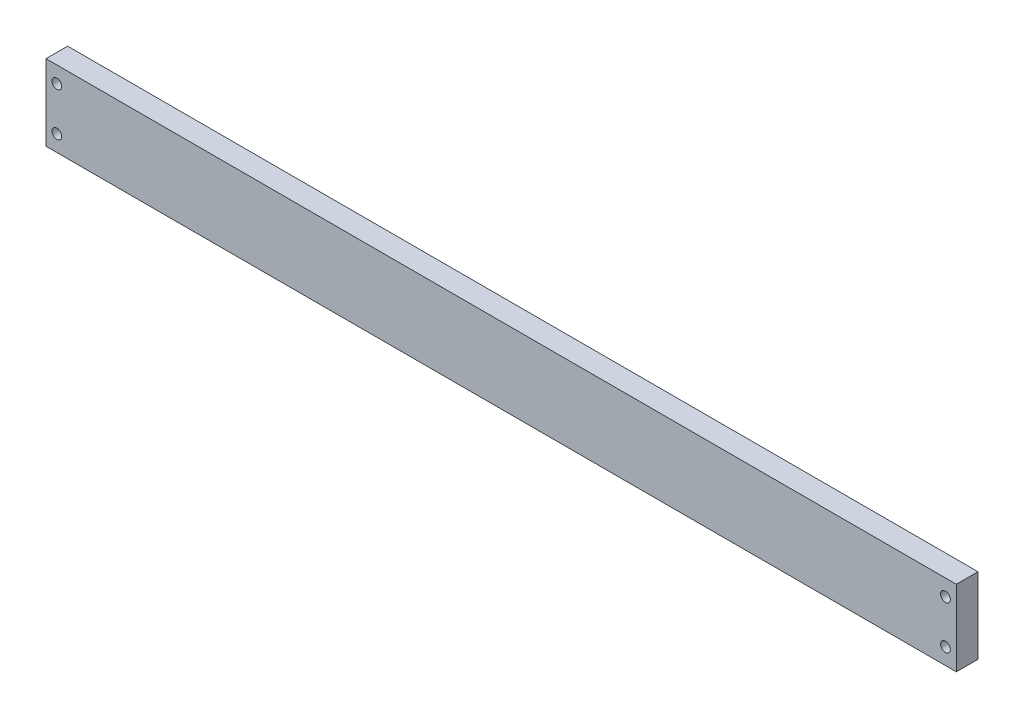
ISO-10303-21;
HEADER;
FILE_DESCRIPTION(('STEP AP214'),'2;1');
FILE_NAME('part.step','',(''),(''),'','','');
FILE_SCHEMA(('AUTOMOTIVE_DESIGN { 1 0 10303 214 1 1 1 1 }'));
ENDSEC;
DATA;
#1=APPLICATION_CONTEXT('core data for automotive mechanical design processes');
#2=APPLICATION_PROTOCOL_DEFINITION('international standard','automotive_design',2000,#1);
#3=PRODUCT_CONTEXT('',#1,'mechanical');
#4=PRODUCT('Part','Part','',(#3));
#5=PRODUCT_RELATED_PRODUCT_CATEGORY('part','',(#4));
#6=PRODUCT_DEFINITION_FORMATION('','',#4);
#7=PRODUCT_DEFINITION_CONTEXT('part definition',#1,'design');
#8=PRODUCT_DEFINITION('design','',#6,#7);
#9=PRODUCT_DEFINITION_SHAPE('','',#8);
#10=(LENGTH_UNIT() NAMED_UNIT(*) SI_UNIT(.MILLI.,.METRE.));
#11=(NAMED_UNIT(*) PLANE_ANGLE_UNIT() SI_UNIT($,.RADIAN.));
#12=(NAMED_UNIT(*) SI_UNIT($,.STERADIAN.) SOLID_ANGLE_UNIT());
#13=UNCERTAINTY_MEASURE_WITH_UNIT(LENGTH_MEASURE(1.E-05),#10,'distance_accuracy_value','');
#14=(GEOMETRIC_REPRESENTATION_CONTEXT(3) GLOBAL_UNCERTAINTY_ASSIGNED_CONTEXT((#13)) GLOBAL_UNIT_ASSIGNED_CONTEXT((#10,
#11,#12)) REPRESENTATION_CONTEXT('',''));
#15=CARTESIAN_POINT('',(0.,0.,0.));
#16=DIRECTION('',(0.,0.,1.));
#17=DIRECTION('',(1.,0.,0.));
#18=AXIS2_PLACEMENT_3D('',#15,#16,#17);
#19=CARTESIAN_POINT('',(-210.,17.5,10.));
#20=DIRECTION('',(1.,0.,0.));
#21=DIRECTION('',(0.,0.,-1.));
#22=AXIS2_PLACEMENT_3D('',#19,#20,#21);
#23=PLANE('',#22);
#24=DIRECTION('',(0.,-1.,0.));
#25=VECTOR('',#24,1.);
#26=CARTESIAN_POINT('',(-210.,17.5,0.));
#27=LINE('',#26,#25);
#28=CARTESIAN_POINT('',(-210.,17.5,0.));
#29=VERTEX_POINT('',#28);
#30=CARTESIAN_POINT('',(-210.,-17.5,0.));
#31=VERTEX_POINT('',#30);
#32=EDGE_CURVE('E99',#29,#31,#27,.T.);
#33=ORIENTED_EDGE('',*,*,#32,.T.);
#34=DIRECTION('',(0.,0.,-1.));
#35=VECTOR('',#34,1.);
#36=CARTESIAN_POINT('',(-210.,-17.5,10.));
#37=LINE('',#36,#35);
#38=CARTESIAN_POINT('',(-210.,-17.5,10.));
#39=VERTEX_POINT('',#38);
#40=EDGE_CURVE('E11',#39,#31,#37,.T.);
#41=ORIENTED_EDGE('',*,*,#40,.F.);
#42=DIRECTION('',(0.,-1.,0.));
#43=VECTOR('',#42,1.);
#44=CARTESIAN_POINT('',(-210.,17.5,10.));
#45=LINE('',#44,#43);
#46=CARTESIAN_POINT('',(-210.,17.5,10.));
#47=VERTEX_POINT('',#46);
#48=EDGE_CURVE('E87',#47,#39,#45,.T.);
#49=ORIENTED_EDGE('',*,*,#48,.F.);
#50=DIRECTION('',(0.,0.,-1.));
#51=VECTOR('',#50,1.);
#52=CARTESIAN_POINT('',(-210.,17.5,10.));
#53=LINE('',#52,#51);
#54=EDGE_CURVE('E95',#47,#29,#53,.T.);
#55=ORIENTED_EDGE('',*,*,#54,.T.);
#56=EDGE_LOOP('',(#33,#41,#49,#55));
#57=FACE_BOUND('',#56,.T.);
#58=ADVANCED_FACE('F36',(#57),#23,.F.);
#59=CARTESIAN_POINT('',(210.,-17.5,10.));
#60=DIRECTION('',(0.,1.,0.));
#61=DIRECTION('',(-1.,0.,0.));
#62=AXIS2_PLACEMENT_3D('',#59,#60,#61);
#63=PLANE('',#62);
#64=DIRECTION('',(1.,0.,0.));
#65=VECTOR('',#64,1.);
#66=CARTESIAN_POINT('',(210.,-17.5,0.));
#67=LINE('',#66,#65);
#68=CARTESIAN_POINT('',(210.,-17.5,0.));
#69=VERTEX_POINT('',#68);
#70=EDGE_CURVE('E91',#31,#69,#67,.T.);
#71=ORIENTED_EDGE('',*,*,#70,.T.);
#72=DIRECTION('',(0.,0.,-1.));
#73=VECTOR('',#72,1.);
#74=CARTESIAN_POINT('',(210.,-17.5,10.));
#75=LINE('',#74,#73);
#76=CARTESIAN_POINT('',(210.,-17.5,10.));
#77=VERTEX_POINT('',#76);
#78=EDGE_CURVE('E44',#77,#69,#75,.T.);
#79=ORIENTED_EDGE('',*,*,#78,.F.);
#80=DIRECTION('',(1.,0.,0.));
#81=VECTOR('',#80,1.);
#82=CARTESIAN_POINT('',(210.,-17.5,10.));
#83=LINE('',#82,#81);
#84=EDGE_CURVE('E82',#39,#77,#83,.T.);
#85=ORIENTED_EDGE('',*,*,#84,.F.);
#86=ORIENTED_EDGE('',*,*,#40,.T.);
#87=EDGE_LOOP('',(#71,#79,#85,#86));
#88=FACE_BOUND('',#87,.T.);
#89=ADVANCED_FACE('F90',(#88),#63,.F.);
#90=CARTESIAN_POINT('',(210.,17.5,10.));
#91=DIRECTION('',(-1.,0.,0.));
#92=DIRECTION('',(0.,0.,1.));
#93=AXIS2_PLACEMENT_3D('',#90,#91,#92);
#94=PLANE('',#93);
#95=DIRECTION('',(0.,1.,0.));
#96=VECTOR('',#95,1.);
#97=CARTESIAN_POINT('',(210.,17.5,0.));
#98=LINE('',#97,#96);
#99=CARTESIAN_POINT('',(210.,17.5,0.));
#100=VERTEX_POINT('',#99);
#101=EDGE_CURVE('E69',#69,#100,#98,.T.);
#102=ORIENTED_EDGE('',*,*,#101,.T.);
#103=DIRECTION('',(0.,0.,-1.));
#104=VECTOR('',#103,1.);
#105=CARTESIAN_POINT('',(210.,17.5,10.));
#106=LINE('',#105,#104);
#107=CARTESIAN_POINT('',(210.,17.5,10.));
#108=VERTEX_POINT('',#107);
#109=EDGE_CURVE('E92',#108,#100,#106,.T.);
#110=ORIENTED_EDGE('',*,*,#109,.F.);
#111=DIRECTION('',(0.,1.,0.));
#112=VECTOR('',#111,1.);
#113=CARTESIAN_POINT('',(210.,17.5,10.));
#114=LINE('',#113,#112);
#115=EDGE_CURVE('E85',#77,#108,#114,.T.);
#116=ORIENTED_EDGE('',*,*,#115,.F.);
#117=ORIENTED_EDGE('',*,*,#78,.T.);
#118=EDGE_LOOP('',(#102,#110,#116,#117));
#119=FACE_BOUND('',#118,.T.);
#120=ADVANCED_FACE('F93',(#119),#94,.F.);
#121=CARTESIAN_POINT('',(210.,17.5,10.));
#122=DIRECTION('',(0.,-1.,0.));
#123=DIRECTION('',(1.,0.,0.));
#124=AXIS2_PLACEMENT_3D('',#121,#122,#123);
#125=PLANE('',#124);
#126=DIRECTION('',(-1.,0.,0.));
#127=VECTOR('',#126,1.);
#128=CARTESIAN_POINT('',(210.,17.5,0.));
#129=LINE('',#128,#127);
#130=EDGE_CURVE('E75',#100,#29,#129,.T.);
#131=ORIENTED_EDGE('',*,*,#130,.T.);
#132=ORIENTED_EDGE('',*,*,#54,.F.);
#133=DIRECTION('',(-1.,0.,0.));
#134=VECTOR('',#133,1.);
#135=CARTESIAN_POINT('',(210.,17.5,10.));
#136=LINE('',#135,#134);
#137=EDGE_CURVE('E52',#108,#47,#136,.T.);
#138=ORIENTED_EDGE('',*,*,#137,.F.);
#139=ORIENTED_EDGE('',*,*,#109,.T.);
#140=EDGE_LOOP('',(#131,#132,#138,#139));
#141=FACE_BOUND('',#140,.T.);
#142=ADVANCED_FACE('F107',(#141),#125,.F.);
#143=CARTESIAN_POINT('',(0.,0.,10.));
#144=DIRECTION('',(0.,0.,-1.));
#145=DIRECTION('',(-1.,0.,0.));
#146=AXIS2_PLACEMENT_3D('',#143,#144,#145);
#147=PLANE('',#146);
#148=CARTESIAN_POINT('',(205.,-9.99999999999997,10.));
#149=DIRECTION('',(0.,0.,-1.));
#150=DIRECTION('',(-1.,0.,0.));
#151=AXIS2_PLACEMENT_3D('',#148,#149,#150);
#152=CIRCLE('',#151,2.25000000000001);
#153=CARTESIAN_POINT('',(202.75,-9.99999999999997,10.));
#154=VERTEX_POINT('',#153);
#155=EDGE_CURVE('E116',#154,#154,#152,.T.);
#156=ORIENTED_EDGE('',*,*,#155,.T.);
#157=EDGE_LOOP('',(#156));
#158=FACE_BOUND('',#157,.T.);
#159=CARTESIAN_POINT('',(-205.,-9.99999999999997,10.));
#160=DIRECTION('',(0.,0.,-1.));
#161=DIRECTION('',(-1.,0.,0.));
#162=AXIS2_PLACEMENT_3D('',#159,#160,#161);
#163=CIRCLE('',#162,2.25000000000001);
#164=CARTESIAN_POINT('',(-207.25,-9.99999999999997,10.));
#165=VERTEX_POINT('',#164);
#166=EDGE_CURVE('E128',#165,#165,#163,.T.);
#167=ORIENTED_EDGE('',*,*,#166,.T.);
#168=EDGE_LOOP('',(#167));
#169=FACE_BOUND('',#168,.T.);
#170=CARTESIAN_POINT('',(-205.,10.,10.));
#171=DIRECTION('',(0.,0.,-1.));
#172=DIRECTION('',(-1.,0.,0.));
#173=AXIS2_PLACEMENT_3D('',#170,#171,#172);
#174=CIRCLE('',#173,2.25000000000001);
#175=CARTESIAN_POINT('',(-207.25,10.,10.));
#176=VERTEX_POINT('',#175);
#177=EDGE_CURVE('E122',#176,#176,#174,.T.);
#178=ORIENTED_EDGE('',*,*,#177,.T.);
#179=EDGE_LOOP('',(#178));
#180=FACE_BOUND('',#179,.T.);
#181=CARTESIAN_POINT('',(205.,10.,10.));
#182=DIRECTION('',(0.,0.,-1.));
#183=DIRECTION('',(-1.,0.,0.));
#184=AXIS2_PLACEMENT_3D('',#181,#182,#183);
#185=CIRCLE('',#184,2.25000000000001);
#186=CARTESIAN_POINT('',(202.75,10.,10.));
#187=VERTEX_POINT('',#186);
#188=EDGE_CURVE('E102',#187,#187,#185,.T.);
#189=ORIENTED_EDGE('',*,*,#188,.T.);
#190=EDGE_LOOP('',(#189));
#191=FACE_BOUND('',#190,.T.);
#192=ORIENTED_EDGE('',*,*,#48,.T.);
#193=ORIENTED_EDGE('',*,*,#84,.T.);
#194=ORIENTED_EDGE('',*,*,#115,.T.);
#195=ORIENTED_EDGE('',*,*,#137,.T.);
#196=EDGE_LOOP('',(#192,#193,#194,#195));
#197=FACE_BOUND('',#196,.T.);
#198=ADVANCED_FACE('F83',(#158,#169,#180,#191,#197),#147,.F.);
#199=CARTESIAN_POINT('',(0.,0.,0.));
#200=DIRECTION('',(0.,0.,-1.));
#201=DIRECTION('',(-1.,0.,0.));
#202=AXIS2_PLACEMENT_3D('',#199,#200,#201);
#203=PLANE('',#202);
#204=CARTESIAN_POINT('',(205.,-9.99999999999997,0.));
#205=DIRECTION('',(0.,0.,-1.));
#206=DIRECTION('',(-1.,0.,0.));
#207=AXIS2_PLACEMENT_3D('',#204,#205,#206);
#208=CIRCLE('',#207,2.25000000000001);
#209=CARTESIAN_POINT('',(202.75,-9.99999999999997,0.));
#210=VERTEX_POINT('',#209);
#211=EDGE_CURVE('E131',#210,#210,#208,.T.);
#212=ORIENTED_EDGE('',*,*,#211,.F.);
#213=EDGE_LOOP('',(#212));
#214=FACE_BOUND('',#213,.T.);
#215=CARTESIAN_POINT('',(-205.,-9.99999999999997,0.));
#216=DIRECTION('',(0.,0.,-1.));
#217=DIRECTION('',(-1.,0.,0.));
#218=AXIS2_PLACEMENT_3D('',#215,#216,#217);
#219=CIRCLE('',#218,2.25000000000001);
#220=CARTESIAN_POINT('',(-207.25,-9.99999999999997,0.));
#221=VERTEX_POINT('',#220);
#222=EDGE_CURVE('E125',#221,#221,#219,.T.);
#223=ORIENTED_EDGE('',*,*,#222,.F.);
#224=EDGE_LOOP('',(#223));
#225=FACE_BOUND('',#224,.T.);
#226=CARTESIAN_POINT('',(-205.,10.,0.));
#227=DIRECTION('',(0.,0.,-1.));
#228=DIRECTION('',(-1.,0.,0.));
#229=AXIS2_PLACEMENT_3D('',#226,#227,#228);
#230=CIRCLE('',#229,2.25000000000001);
#231=CARTESIAN_POINT('',(-207.25,10.,0.));
#232=VERTEX_POINT('',#231);
#233=EDGE_CURVE('E119',#232,#232,#230,.T.);
#234=ORIENTED_EDGE('',*,*,#233,.F.);
#235=EDGE_LOOP('',(#234));
#236=FACE_BOUND('',#235,.T.);
#237=CARTESIAN_POINT('',(205.,10.,0.));
#238=DIRECTION('',(0.,0.,-1.));
#239=DIRECTION('',(-1.,0.,0.));
#240=AXIS2_PLACEMENT_3D('',#237,#238,#239);
#241=CIRCLE('',#240,2.25000000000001);
#242=CARTESIAN_POINT('',(202.75,10.,0.));
#243=VERTEX_POINT('',#242);
#244=EDGE_CURVE('E113',#243,#243,#241,.T.);
#245=ORIENTED_EDGE('',*,*,#244,.F.);
#246=EDGE_LOOP('',(#245));
#247=FACE_BOUND('',#246,.T.);
#248=ORIENTED_EDGE('',*,*,#32,.F.);
#249=ORIENTED_EDGE('',*,*,#130,.F.);
#250=ORIENTED_EDGE('',*,*,#101,.F.);
#251=ORIENTED_EDGE('',*,*,#70,.F.);
#252=EDGE_LOOP('',(#248,#249,#250,#251));
#253=FACE_BOUND('',#252,.T.);
#254=ADVANCED_FACE('F110',(#214,#225,#236,#247,#253),#203,.T.);
#255=CARTESIAN_POINT('',(205.,10.,10.));
#256=DIRECTION('',(0.,0.,-1.));
#257=DIRECTION('',(-1.,0.,0.));
#258=AXIS2_PLACEMENT_3D('',#255,#256,#257);
#259=CYLINDRICAL_SURFACE('',#258,2.25000000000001);
#260=ORIENTED_EDGE('',*,*,#188,.F.);
#261=EDGE_LOOP('',(#260));
#262=FACE_BOUND('',#261,.T.);
#263=ORIENTED_EDGE('',*,*,#244,.T.);
#264=EDGE_LOOP('',(#263));
#265=FACE_BOUND('',#264,.T.);
#266=ADVANCED_FACE('F148',(#262,#265),#259,.F.);
#267=CARTESIAN_POINT('',(-205.,10.,10.));
#268=DIRECTION('',(0.,0.,-1.));
#269=DIRECTION('',(-1.,0.,0.));
#270=AXIS2_PLACEMENT_3D('',#267,#268,#269);
#271=CYLINDRICAL_SURFACE('',#270,2.25000000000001);
#272=ORIENTED_EDGE('',*,*,#177,.F.);
#273=EDGE_LOOP('',(#272));
#274=FACE_BOUND('',#273,.T.);
#275=ORIENTED_EDGE('',*,*,#233,.T.);
#276=EDGE_LOOP('',(#275));
#277=FACE_BOUND('',#276,.T.);
#278=ADVANCED_FACE('F157',(#274,#277),#271,.F.);
#279=CARTESIAN_POINT('',(-205.,-9.99999999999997,10.));
#280=DIRECTION('',(0.,0.,-1.));
#281=DIRECTION('',(-1.,0.,0.));
#282=AXIS2_PLACEMENT_3D('',#279,#280,#281);
#283=CYLINDRICAL_SURFACE('',#282,2.25000000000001);
#284=ORIENTED_EDGE('',*,*,#166,.F.);
#285=EDGE_LOOP('',(#284));
#286=FACE_BOUND('',#285,.T.);
#287=ORIENTED_EDGE('',*,*,#222,.T.);
#288=EDGE_LOOP('',(#287));
#289=FACE_BOUND('',#288,.T.);
#290=ADVANCED_FACE('F142',(#286,#289),#283,.F.);
#291=CARTESIAN_POINT('',(205.,-9.99999999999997,10.));
#292=DIRECTION('',(0.,0.,-1.));
#293=DIRECTION('',(-1.,0.,0.));
#294=AXIS2_PLACEMENT_3D('',#291,#292,#293);
#295=CYLINDRICAL_SURFACE('',#294,2.25000000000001);
#296=ORIENTED_EDGE('',*,*,#155,.F.);
#297=EDGE_LOOP('',(#296));
#298=FACE_BOUND('',#297,.T.);
#299=ORIENTED_EDGE('',*,*,#211,.T.);
#300=EDGE_LOOP('',(#299));
#301=FACE_BOUND('',#300,.T.);
#302=ADVANCED_FACE('F139',(#298,#301),#295,.F.);
#303=CLOSED_SHELL('',(#58,#89,#120,#142,#198,#254,#266,#278,#290,#302));
#304=MANIFOLD_SOLID_BREP('B2',#303);
#305=ADVANCED_BREP_SHAPE_REPRESENTATION('',(#18,#304),#14);
#306=SHAPE_DEFINITION_REPRESENTATION(#9,#305);
ENDSEC;
END-ISO-10303-21;
